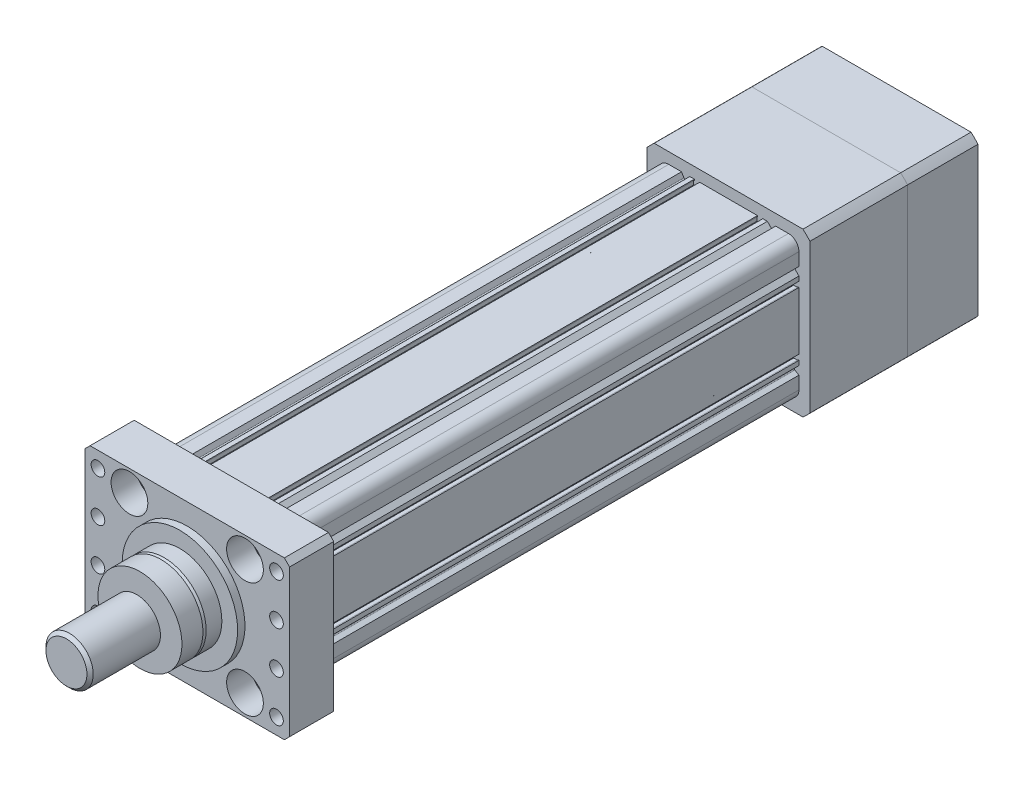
from build123d import *

# Parameters (mm, degrees)
SKETCH_1_R          = 6
EXTRUDE_1_DEPTH     = 473.5
EXTRUDE_1_2_DEPTH   = 42
SKETCH_3_R          = 6.5
SKETCH_3_R_2        = 8.5
CUT_EXTRUDE_1_DEPTH = 42
SKETCH_3_3_R        = 17.5
SKETCH_3_3_R_2      = 8.5
CUT_EXTRUDE_2_DEPTH = 24
SKETCH_3_4_R        = 55
EXTRUDE_2_DEPTH     = 7
SKETCH_4_R          = 40
EXTRUDE_3_DEPTH     = 18
CHAMFER_1_SIZE      = 3
CHAMFER_1_SIZE2     = 1.091910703
SKETCH_5_R          = 40
EXTRUDE_4_DEPTH     = 20
SKETCH_6_R          = 16.5
EXTRUDE_5_DEPTH     = 3
SKETCH_7_R          = 22.5
EXTRUDE_6_DEPTH     = 67
FILLET_1_R          = 1
CHAMFER_2_SIZE      = 3
EXTRUDE_7_DEPTH     = 93
EXTRUDE_8_DEPTH     = 67
SKETCH_10_R         = 65
CUT_EXTRUDE_3_DEPTH = 19
SKETCH_11_R         = 47
CUT_EXTRUDE_4_DEPTH = 47
SKETCH_12_R         = 10
CUT_EXTRUDE_5_DEPTH = 12


with BuildPart() as part:
    # Sketch 1 → Extrude 1 (new body)
    with BuildSketch(Plane.XY):
        with BuildLine():
            Line((57, 67), (44.8, 67))
            Line((44.8, 67), (42.56486134, 63.12862628))
            ThreePointArc((42.56486134, 63.12862628), (41.829362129, 62.637181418), (40.991729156, 62.921519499))
            Line((40.991729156, 62.921519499), (36.913248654, 67))
            Line((36.913248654, 67), (32.6, 67))
            Line((32.6, 67), (32.6, 66.1))
            Line((32.6, 66.1), (33.2, 65.5))
            Line((33.2, 65.5), (33.2, 62))
            Line((33.2, 62), (26.9, 62))
            Line((26.9, 62), (26.9, 65.5))
            Line((26.9, 65.5), (27.5, 66.1))
            Line((27.5, 66.1), (27.5, 67))
            Line((27.5, 67), (0, 67))
            Line((0, 67), (-27.5, 67))
            Line((-27.5, 67), (-27.5, 66.1))
            Line((-27.5, 66.1), (-26.9, 65.5))
            Line((-26.9, 65.5), (-26.9, 62))
            Line((-26.9, 62), (-33.2, 62))
            Line((-33.2, 62), (-33.2, 65.5))
            Line((-33.2, 65.5), (-32.6, 66.1))
            Line((-32.6, 66.1), (-32.6, 67))
            Line((-32.6, 67), (-36.913248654, 67))
            Line((-36.913248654, 67), (-40.991729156, 62.921519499))
            ThreePointArc((-40.991729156, 62.921519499), (-41.829362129, 62.637181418), (-42.56486134, 63.12862628))
            Line((-42.56486134, 63.12862628), (-44.8, 67))
            Line((-44.8, 67), (-57, 67))
            ThreePointArc((-57, 67), (-64.071067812, 64.071067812), (-67, 57))
            Line((-67, 57), (-67, 44.8))
            Line((-67, 44.8), (-63.12862628, 42.56486134))
            ThreePointArc((-63.12862628, 42.56486134), (-62.637181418, 41.829362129), (-62.921519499, 40.991729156))
            Line((-62.921519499, 40.991729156), (-67, 36.913248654))
            Line((-67, 36.913248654), (-67, 32.6))
            Line((-67, 32.6), (-66.1, 32.6))
            Line((-66.1, 32.6), (-65.5, 33.2))
            Line((-65.5, 33.2), (-62, 33.2))
            Line((-62, 33.2), (-62, 26.9))
            Line((-62, 26.9), (-65.5, 26.9))
            Line((-65.5, 26.9), (-66.1, 27.5))
            Line((-66.1, 27.5), (-67, 27.5))
            Line((-67, 27.5), (-67, 0))
            Line((-67, 0), (-67, -27.5))
            Line((-67, -27.5), (-66.1, -27.5))
            Line((-66.1, -27.5), (-65.5, -26.9))
            Line((-65.5, -26.9), (-62, -26.9))
            Line((-62, -26.9), (-62, -33.2))
            Line((-62, -33.2), (-65.5, -33.2))
            Line((-65.5, -33.2), (-66.1, -32.6))
            Line((-66.1, -32.6), (-67, -32.6))
            Line((-67, -32.6), (-67, -36.913248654))
            Line((-67, -36.913248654), (-62.921519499, -40.991729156))
            ThreePointArc((-62.921519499, -40.991729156), (-62.637181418, -41.829362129), (-63.12862628, -42.56486134))
            Line((-63.12862628, -42.56486134), (-67, -44.8))
            Line((-67, -44.8), (-67, -57))
            ThreePointArc((-67, -57), (-64.071067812, -64.071067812), (-57, -67))
            Line((-57, -67), (-44.8, -67))
            Line((-44.8, -67), (-42.56486134, -63.12862628))
            ThreePointArc((-42.56486134, -63.12862628), (-41.829362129, -62.637181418), (-40.991729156, -62.921519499))
            Line((-40.991729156, -62.921519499), (-36.913248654, -67))
            Line((-36.913248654, -67), (36.913248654, -67))
            Line((36.913248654, -67), (40.991729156, -62.921519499))
            ThreePointArc((40.991729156, -62.921519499), (41.829362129, -62.637181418), (42.56486134, -63.12862628))
            Line((42.56486134, -63.12862628), (44.8, -67))
            Line((44.8, -67), (57, -67))
            ThreePointArc((57, -67), (64.071067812, -64.071067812), (67, -57))
            Line((67, -57), (67, -44.8))
            Line((67, -44.8), (63.12862628, -42.56486134))
            ThreePointArc((63.12862628, -42.56486134), (62.637181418, -41.829362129), (62.921519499, -40.991729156))
            Line((62.921519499, -40.991729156), (67, -36.913248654))
            Line((67, -36.913248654), (67, -32.6))
            Line((67, -32.6), (66.1, -32.6))
            Line((66.1, -32.6), (65.5, -33.2))
            Line((65.5, -33.2), (62, -33.2))
            Line((62, -33.2), (62, -26.9))
            Line((62, -26.9), (65.5, -26.9))
            Line((65.5, -26.9), (66.1, -27.5))
            Line((66.1, -27.5), (67, -27.5))
            Line((67, -27.5), (67, 0))
            Line((67, 0), (67, 27.5))
            Line((67, 27.5), (66.1, 27.5))
            Line((66.1, 27.5), (65.5, 26.9))
            Line((65.5, 26.9), (62, 26.9))
            Line((62, 26.9), (62, 33.2))
            Line((62, 33.2), (65.5, 33.2))
            Line((65.5, 33.2), (66.1, 32.6))
            Line((66.1, 32.6), (67, 32.6))
            Line((67, 32.6), (67, 36.913248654))
            Line((67, 36.913248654), (62.921519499, 40.991729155))
            ThreePointArc((62.921519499, 40.991729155), (62.637181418, 41.829362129), (63.12862628, 42.56486134))
            Line((63.12862628, 42.56486134), (67, 44.8))
            Line((67, 44.8), (67, 57))
            ThreePointArc((67, 57), (64.071067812, 64.071067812), (57, 67))
        make_face()
        with Locations((-55, 55)):
            Circle(SKETCH_1_R, mode=Mode.SUBTRACT)
        with Locations((55, 55)):
            Circle(SKETCH_1_R, mode=Mode.SUBTRACT)
        with Locations((-55, -55)):
            Circle(SKETCH_1_R, mode=Mode.SUBTRACT)
        with Locations((55, -55)):
            Circle(SKETCH_1_R, mode=Mode.SUBTRACT)
        with BuildLine():
            Line((41.774779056, 51.785063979), (43.601329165, 54.94874157))
            ThreePointArc((43.601329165, 54.94874157), (43.701229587, 55.707560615), (43.235303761, 56.314766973))
            Line((43.235303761, 56.314766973), (39.616756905, 58.403935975))
            ThreePointArc((39.616756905, 58.403935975), (39.337726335, 58.513191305), (39.038853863, 58.534871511))
            Line((39.038853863, 58.534871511), (35.747329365, 58.277670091))
            ThreePointArc((35.747329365, 58.277670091), (35.481311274, 58.1068038), (35.28193171, 57.86142918))
            Line((35.28193171, 57.86142918), (34.274000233, 56.115640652))
            ThreePointArc((34.274000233, 56.115640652), (34.174099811, 55.356821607), (34.640025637, 54.749615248))
            Line((34.640025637, 54.749615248), (40.408753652, 51.419038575))
            ThreePointArc((40.408753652, 51.419038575), (41.167572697, 51.319138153), (41.774779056, 51.785063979))
        make_face(mode=Mode.SUBTRACT)
        with BuildLine():
            Line((51.785063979, 41.774779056), (54.94874157, 43.601329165))
            ThreePointArc((54.94874157, 43.601329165), (55.707560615, 43.701229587), (56.314766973, 43.235303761))
            Line((56.314766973, 43.235303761), (58.403935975, 39.616756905))
            ThreePointArc((58.403935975, 39.616756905), (58.513191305, 39.337726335), (58.534871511, 39.038853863))
            Line((58.534871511, 39.038853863), (58.277670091, 35.747329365))
            ThreePointArc((58.277670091, 35.747329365), (58.1068038, 35.481311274), (57.86142918, 35.28193171))
            Line((57.86142918, 35.28193171), (56.115640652, 34.274000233))
            ThreePointArc((56.115640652, 34.274000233), (55.356821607, 34.174099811), (54.749615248, 34.640025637))
            Line((54.749615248, 34.640025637), (51.419038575, 40.408753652))
            ThreePointArc((51.419038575, 40.408753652), (51.319138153, 41.167572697), (51.785063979, 41.774779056))
        make_face(mode=Mode.SUBTRACT)
        with BuildLine():
            Line((-57.86142918, 35.28193171), (-56.115640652, 34.274000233))
            ThreePointArc((-56.115640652, 34.274000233), (-55.356821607, 34.174099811), (-54.749615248, 34.640025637))
            Line((-54.749615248, 34.640025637), (-51.419038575, 40.408753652))
            ThreePointArc((-51.419038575, 40.408753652), (-51.319138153, 41.167572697), (-51.785063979, 41.774779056))
            Line((-51.785063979, 41.774779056), (-54.94874157, 43.601329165))
            ThreePointArc((-54.94874157, 43.601329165), (-55.707560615, 43.701229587), (-56.314766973, 43.235303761))
            Line((-56.314766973, 43.235303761), (-58.403935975, 39.616756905))
            ThreePointArc((-58.403935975, 39.616756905), (-58.513191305, 39.337726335), (-58.534871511, 39.038853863))
            Line((-58.534871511, 39.038853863), (-58.277670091, 35.747329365))
            ThreePointArc((-58.277670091, 35.747329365), (-58.1068038, 35.481311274), (-57.86142918, 35.28193171))
        make_face(mode=Mode.SUBTRACT)
        with BuildLine():
            Line((-33.360371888, -64.600232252), (-19.423193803, -64.600232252))
            ThreePointArc((-19.423193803, -64.600232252), (-18.434155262, -63.747889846), (-19.1311157, -62.643837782))
            ThreePointArc((-19.1311157, -62.643837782), (-26.690004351, -59.815496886), (-33.843674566, -56.079012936))
            ThreePointArc((-33.843674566, -56.079012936), (-34.851952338, -56.064348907), (-35.360371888, -56.935181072))
            Line((-35.360371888, -56.935181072), (-35.360371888, -62.600232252))
            Line((-35.360371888, -62.600232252), (-33.360371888, -64.600232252))
        make_face(mode=Mode.SUBTRACT)
        with BuildLine():
            Line((35.360371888, -62.600232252), (33.360371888, -64.600232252))
            Line((33.360371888, -64.600232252), (19.423193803, -64.600232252))
            ThreePointArc((19.423193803, -64.600232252), (18.434155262, -63.747889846), (19.1311157, -62.643837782))
            ThreePointArc((19.1311157, -62.643837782), (26.690004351, -59.815496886), (33.843674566, -56.079012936))
            ThreePointArc((33.843674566, -56.079012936), (34.851952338, -56.064348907), (35.360371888, -56.935181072))
            Line((35.360371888, -56.935181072), (35.360371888, -62.600232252))
        make_face(mode=Mode.SUBTRACT)
        with BuildLine():
            Line((51.785063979, -41.774779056), (54.94874157, -43.601329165))
            ThreePointArc((54.94874157, -43.601329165), (55.707560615, -43.701229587), (56.314766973, -43.235303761))
            Line((56.314766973, -43.235303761), (58.403935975, -39.616756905))
            ThreePointArc((58.403935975, -39.616756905), (58.513191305, -39.337726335), (58.534871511, -39.038853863))
            Line((58.534871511, -39.038853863), (58.277670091, -35.747329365))
            ThreePointArc((58.277670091, -35.747329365), (58.1068038, -35.481311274), (57.86142918, -35.28193171))
            Line((57.86142918, -35.28193171), (56.115640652, -34.274000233))
            ThreePointArc((56.115640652, -34.274000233), (55.356821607, -34.174099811), (54.749615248, -34.640025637))
            Line((54.749615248, -34.640025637), (51.419038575, -40.408753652))
            ThreePointArc((51.419038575, -40.408753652), (51.319138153, -41.167572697), (51.785063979, -41.774779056))
        make_face(mode=Mode.SUBTRACT)
        with BuildLine():
            Line((-57.86142918, -35.28193171), (-56.115640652, -34.274000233))
            ThreePointArc((-56.115640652, -34.274000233), (-55.356821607, -34.174099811), (-54.749615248, -34.640025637))
            Line((-54.749615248, -34.640025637), (-51.419038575, -40.408753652))
            ThreePointArc((-51.419038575, -40.408753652), (-51.319138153, -41.167572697), (-51.785063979, -41.774779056))
            Line((-51.785063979, -41.774779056), (-54.94874157, -43.601329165))
            ThreePointArc((-54.94874157, -43.601329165), (-55.707560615, -43.701229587), (-56.314766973, -43.235303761))
            Line((-56.314766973, -43.235303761), (-58.403935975, -39.616756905))
            ThreePointArc((-58.403935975, -39.616756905), (-58.513191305, -39.337726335), (-58.534871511, -39.038853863))
            Line((-58.534871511, -39.038853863), (-58.277670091, -35.747329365))
            ThreePointArc((-58.277670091, -35.747329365), (-58.1068038, -35.481311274), (-57.86142918, -35.28193171))
        make_face(mode=Mode.SUBTRACT)
        with BuildLine():
            Line((-41.774779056, 51.785063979), (-43.601329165, 54.94874157))
            ThreePointArc((-43.601329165, 54.94874157), (-43.701229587, 55.707560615), (-43.235303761, 56.314766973))
            Line((-43.235303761, 56.314766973), (-39.616756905, 58.403935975))
            ThreePointArc((-39.616756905, 58.403935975), (-39.337726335, 58.513191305), (-39.038853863, 58.534871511))
            Line((-39.038853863, 58.534871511), (-35.747329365, 58.277670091))
            ThreePointArc((-35.747329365, 58.277670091), (-35.481311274, 58.1068038), (-35.28193171, 57.86142918))
            Line((-35.28193171, 57.86142918), (-34.274000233, 56.115640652))
            ThreePointArc((-34.274000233, 56.115640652), (-34.174099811, 55.356821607), (-34.640025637, 54.749615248))
            Line((-34.640025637, 54.749615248), (-40.408753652, 51.419038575))
            ThreePointArc((-40.408753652, 51.419038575), (-41.167572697, 51.319138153), (-41.774779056, 51.785063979))
        make_face(mode=Mode.SUBTRACT)
        with BuildLine():
            ThreePointArc((62.5, 0), (0, 62.5), (-62.5, 0))
            ThreePointArc((-62.5, 0), (0, -62.5), (62.5, 0))
        make_face(mode=Mode.SUBTRACT)
    extrude(amount=EXTRUDE_1_DEPTH)

    # Sketch 2 → Extrude 1 2 (add)
    with BuildSketch(Plane.XY.offset(473.5)):
        Polygon((-97.5, 70), (-92.5, 75), (92.5, 75), (97.5, 70), (97.5, -70), (92.5, -75), (-92.5, -75), (-97.5, -70), align=None)
    extrude(amount=EXTRUDE_1_2_DEPTH)

    # Sketch 3 → Cut-Extrude 1 (cut)
    with BuildSketch(Plane.XY.offset(515.5)):
        with Locations((-85, 20)):
            Circle(SKETCH_3_R)
        with Locations((-85, -20)):
            Circle(SKETCH_3_R)
        with Locations((-85, -60)):
            Circle(SKETCH_3_R)
        with Locations((-55, -55)):
            Circle(SKETCH_3_R_2)
        with Locations((-55, 55)):
            Circle(SKETCH_3_R_2)
        with Locations((55, 55)):
            Circle(SKETCH_3_R_2)
        with Locations((85, 60)):
            Circle(SKETCH_3_R)
        with Locations((85, 20)):
            Circle(SKETCH_3_R)
        with Locations((85, -20)):
            Circle(SKETCH_3_R)
        with Locations((85, -60)):
            Circle(SKETCH_3_R)
        with Locations((55, -55)):
            Circle(SKETCH_3_R_2)
        with Locations((-85, 60)):
            Circle(SKETCH_3_R)
    extrude(amount=-CUT_EXTRUDE_1_DEPTH, mode=Mode.SUBTRACT)

    # Sketch 3_3 → Cut-Extrude 2 (cut)
    # profile 1 of 4: a face of its own
    with BuildSketch(Plane.XY.offset(515.5)):
        with Locations((55, 55)):
            Circle(SKETCH_3_3_R)
        with Locations((55, 55)):
            Circle(SKETCH_3_3_R_2, mode=Mode.SUBTRACT)
    # profile 2 of 4: a face of its own
    with BuildSketch(Plane.XY.offset(515.5)):
        with Locations((55, -55)):
            Circle(SKETCH_3_3_R)
        with Locations((55, -55)):
            Circle(SKETCH_3_3_R_2, mode=Mode.SUBTRACT)
    # profile 3 of 4: a face of its own
    with BuildSketch(Plane.XY.offset(515.5)):
        with Locations((-55, -55)):
            Circle(SKETCH_3_3_R)
        with Locations((-55, -55)):
            Circle(SKETCH_3_3_R_2, mode=Mode.SUBTRACT)
    # profile 4 of 4: a face of its own
    with BuildSketch(Plane.XY.offset(515.5)):
        with Locations((-55, 55)):
            Circle(SKETCH_3_3_R)
    extrude(amount=-CUT_EXTRUDE_2_DEPTH, mode=Mode.SUBTRACT)

    # Sketch 3_4 → Extrude 2 (add)
    with BuildSketch(Plane.XY.offset(515.5)):
        with Locations(Location((0, 0, 0), (0, 0, 180))):
            Circle(SKETCH_3_4_R)
    extrude(amount=EXTRUDE_2_DEPTH)

    # Sketch 4 → Extrude 3 (add)
    with BuildSketch(Plane.XY.offset(522.5)):
        Circle(SKETCH_4_R)
    extrude(amount=EXTRUDE_3_DEPTH)

    # Chamfer 1
    chamfer_1_edges = [part.edges().sort_by_distance(p)[0] for p in [
        (-40, 0, 540.5),
    ]]
    chamfer_1_side = [part.faces().sort_by_distance(p)[0] for p in [
        (-40, 0, 531.5),
    ]]
    chamfer(chamfer_1_edges, length=CHAMFER_1_SIZE, length2=CHAMFER_1_SIZE2, reference=chamfer_1_side[0])

    # Sketch 5 → Extrude 4 (add)
    with BuildSketch(Plane.XY.offset(540.5)):
        Circle(SKETCH_5_R)
    extrude(amount=EXTRUDE_4_DEPTH)

    # Sketch 6 → Extrude 5 (add)
    with BuildSketch(Plane.XY.offset(560.5)):
        Circle(SKETCH_6_R)
    extrude(amount=EXTRUDE_5_DEPTH)

    # Sketch 7 → Extrude 6 (add)
    with BuildSketch(Plane.XY.offset(563.5)):
        Circle(SKETCH_7_R)
    extrude(amount=EXTRUDE_6_DEPTH)

    # Fillet 1
    fillet_1_edges = [part.edges().sort_by_distance(p)[0] for p in [
        (-16.5, 0, 560.5),
    ]]
    fillet(fillet_1_edges, radius=FILLET_1_R)

    # Chamfer 2
    chamfer_2_edges = [part.edges().sort_by_distance(p)[0] for p in [
        (-22.5, 0, 630.5),
    ]]
    chamfer(chamfer_2_edges, length=CHAMFER_2_SIZE)

    # Sketch 8 → Extrude 7 (add)
    with BuildSketch(Plane(origin=(0, 0, 0), x_dir=(-1, 0, 0), z_dir=(0, 0, -1))):
        with BuildLine():
            Line((-70.843136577, 77.5), (70.843136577, 77.5))
            ThreePointArc((70.843136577, 77.5), (74.246212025, 74.246212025), (77.5, 70.843136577))
            Line((77.5, 70.843136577), (77.5, -70.843136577))
            ThreePointArc((77.5, -70.843136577), (74.246212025, -74.246212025), (70.843136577, -77.5))
            Line((70.843136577, -77.5), (-70.843136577, -77.5))
            ThreePointArc((-70.843136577, -77.5), (-74.246212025, -74.246212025), (-77.5, -70.843136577))
            Line((-77.5, -70.843136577), (-77.5, 70.843136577))
            ThreePointArc((-77.5, 70.843136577), (-74.246212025, 74.246212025), (-70.843136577, 77.5))
        make_face()
    extrude(amount=EXTRUDE_7_DEPTH)

    # Sketch 12 → Cut-Extrude 5 (cut)
    with BuildSketch(Plane(origin=(0, 0, 473.5), x_dir=(-1, 0, 0), z_dir=(0, 0, -1))):
        with Locations((-85, -60)):
            Circle(SKETCH_12_R)
        with Locations((85, -60)):
            Circle(SKETCH_12_R)
        with Locations((85, -20)):
            Circle(SKETCH_12_R)
        with Locations((85, 20)):
            Circle(SKETCH_12_R)
        with Locations((85, 60)):
            Circle(SKETCH_12_R)
        with Locations((-85, -20)):
            Circle(SKETCH_12_R)
        with Locations((-85, 20)):
            Circle(SKETCH_12_R)
        with Locations((-85, 60)):
            Circle(SKETCH_12_R)
    extrude(amount=-CUT_EXTRUDE_5_DEPTH, mode=Mode.SUBTRACT)


with BuildPart() as body_2:
    # Sketch 9 → Extrude 8 (new body)
    with BuildSketch(Plane(origin=(0, 0, -93), x_dir=(-1, 0, 0), z_dir=(0, 0, -1))):
        with BuildLine():
            Line((-70.843136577, 77.5), (70.843136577, 77.5))
            ThreePointArc((70.843136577, 77.5), (74.246212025, 74.246212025), (77.5, 70.843136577))
            Line((77.5, 70.843136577), (77.5, -70.843136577))
            ThreePointArc((77.5, -70.843136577), (74.246212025, -74.246212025), (70.843136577, -77.5))
            Line((70.843136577, -77.5), (-70.843136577, -77.5))
            ThreePointArc((-70.843136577, -77.5), (-74.246212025, -74.246212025), (-77.5, -70.843136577))
            Line((-77.5, -70.843136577), (-77.5, 70.843136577))
            ThreePointArc((-77.5, 70.843136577), (-74.246212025, 74.246212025), (-70.843136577, 77.5))
        make_face()
    extrude(amount=EXTRUDE_8_DEPTH)

    # Sketch 10 → Cut-Extrude 3 (cut)
    with BuildSketch(Plane(origin=(0, 0, -160), x_dir=(-1, 0, 0), z_dir=(0, 0, -1))):
        Circle(SKETCH_10_R)
    extrude(amount=-CUT_EXTRUDE_3_DEPTH, mode=Mode.SUBTRACT)

    # Sketch 11 → Cut-Extrude 4 (cut)
    with BuildSketch(Plane(origin=(0, 0, -141), x_dir=(-1, 0, 0), z_dir=(0, 0, -1))):
        Circle(SKETCH_11_R)
    extrude(amount=-CUT_EXTRUDE_4_DEPTH, mode=Mode.SUBTRACT)


solid = Compound([part.part, body_2.part])
